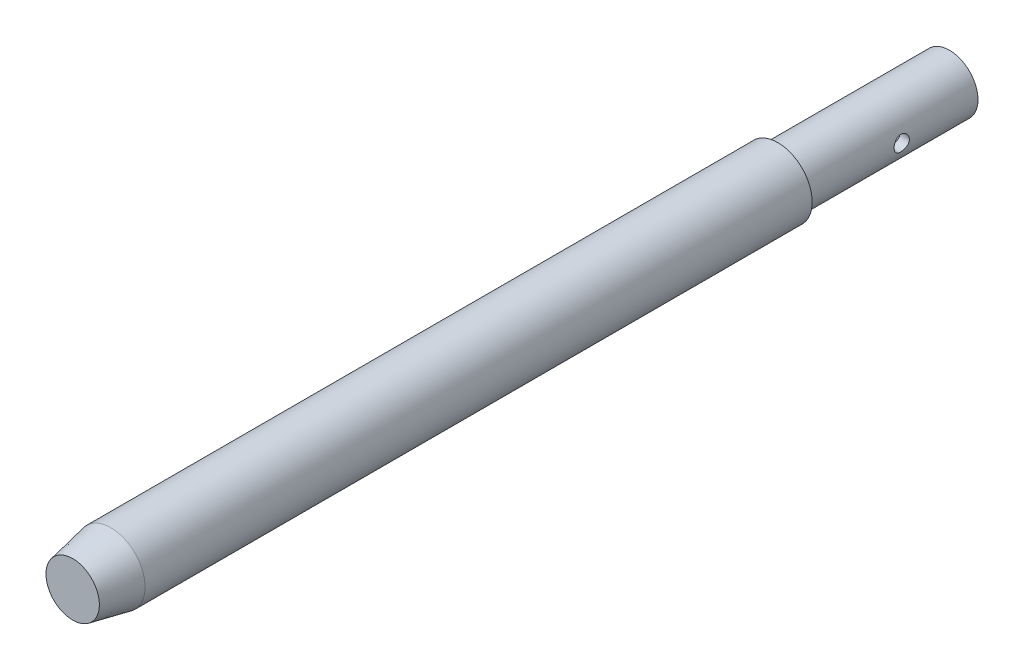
from build123d import *

# Parameters (mm, degrees)
SKETCH_1_R               = 9
EXTRUDE_1_DEPTH          = 185
CHAMFER_1_SIZE           = 10
CHAMFER_1_SIZE2          = 2
SKETCH_2_R               = 7.5
EXTRUDE_2_DEPTH          = 45
SKETCH_3_R               = 5
CUT_EXTRUDE_1_DEPTH      = 35
CUT_EXTRUDE_2_REACH      = 188.191
CUT_EXTRUDE_2_END_RADIUS = 5
SKETCH_4_R               = 2


with BuildPart() as part:
    # Sketch 1 → Extrude 1 (new body)
    with BuildSketch(Plane.XY):
        Circle(SKETCH_1_R)
    extrude(amount=EXTRUDE_1_DEPTH)

    # Chamfer 1
    chamfer_1_edges = [part.edges().sort_by_distance(p)[0] for p in [
        (-9, 0, 185),
    ]]
    chamfer_1_side = [part.faces().sort_by_distance(p)[0] for p in [
        (-9, 0, 92.5),
    ]]
    chamfer(chamfer_1_edges, length=CHAMFER_1_SIZE, length2=CHAMFER_1_SIZE2, reference=chamfer_1_side[0])

    # Sketch 2 → Extrude 2 (add)
    with BuildSketch(Plane(origin=(0, 0, 0), x_dir=(-1, 0, 0), z_dir=(0, 0, -1))):
        with Locations(Location((0, 0, 0), (0, 0, 180))):
            Circle(SKETCH_2_R)
    extrude(amount=EXTRUDE_2_DEPTH)

    # Sketch 3 → Cut-Extrude 1 (cut)
    with BuildSketch(Plane(origin=(0, 0, -45), x_dir=(-1, 0, 0), z_dir=(0, 0, -1))):
        Circle(SKETCH_3_R)
    extrude(amount=-CUT_EXTRUDE_1_DEPTH, mode=Mode.SUBTRACT)

    # Cut-Extrude 2: up to this cylinder (the profile starts outside it)
    cut_extrude_2_end = Plane(origin=(0, 0, -25), z_dir=(0, 0, -1)) * Cylinder(CUT_EXTRUDE_2_END_RADIUS, 387.382, mode=Mode.PRIVATE)
    # Sketch 4 → Cut-Extrude 2 (cut, up to the surface)
    with BuildSketch(Plane(origin=(10, 0, 0), x_dir=(0, 0, -1), z_dir=(1, 0, 0)), mode=Mode.PRIVATE) as cut_extrude_2_sk1:
        with Locations((25, 0)):
            Circle(SKETCH_4_R)
    cut_extrude_2_tool1 = extrude(cut_extrude_2_sk1.sketch, amount=-CUT_EXTRUDE_2_REACH, mode=Mode.PRIVATE) - cut_extrude_2_end
    add(cut_extrude_2_tool1.solids().sort_by_distance((10, 0, -25))[0], mode=Mode.SUBTRACT)


solid = part.part
